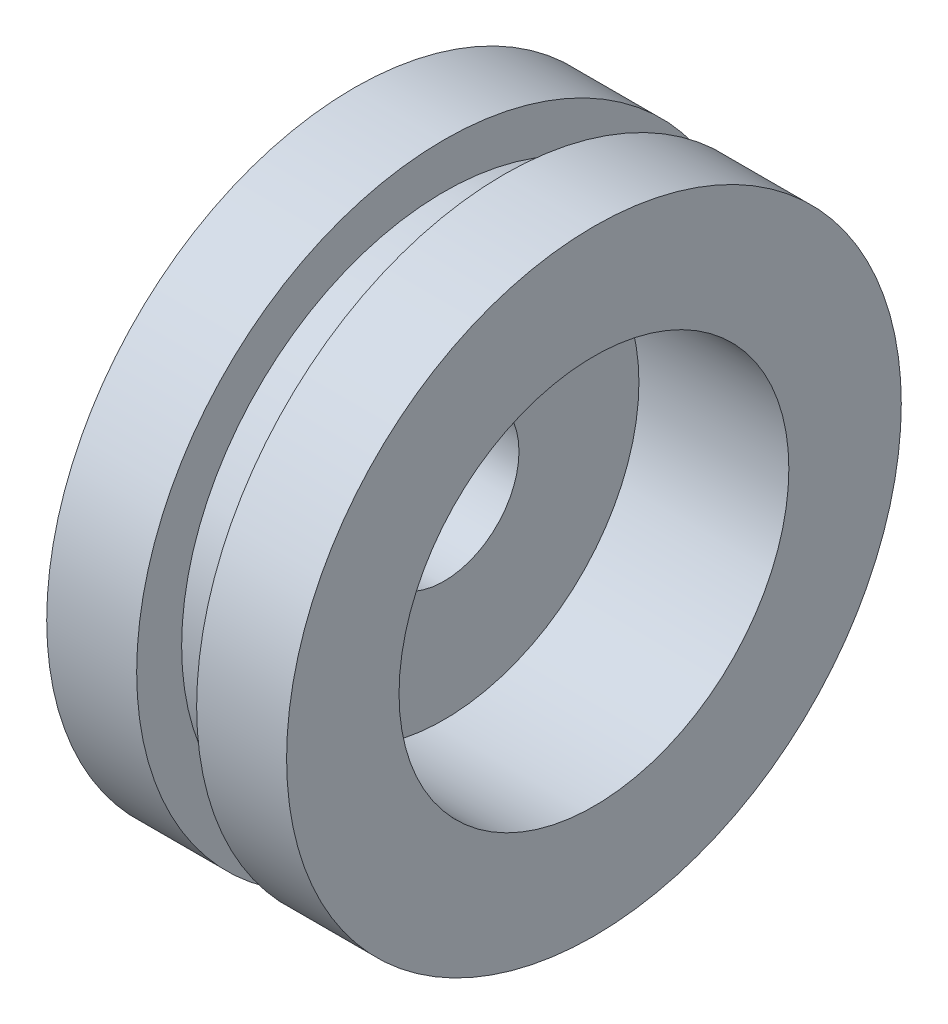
ISO-10303-21;
HEADER;
FILE_DESCRIPTION(('STEP AP214'),'2;1');
FILE_NAME('part.step','',(''),(''),'','','');
FILE_SCHEMA(('AUTOMOTIVE_DESIGN { 1 0 10303 214 1 1 1 1 }'));
ENDSEC;
DATA;
#1=APPLICATION_CONTEXT('core data for automotive mechanical design processes');
#2=APPLICATION_PROTOCOL_DEFINITION('international standard','automotive_design',2000,#1);
#3=PRODUCT_CONTEXT('',#1,'mechanical');
#4=PRODUCT('Part','Part','',(#3));
#5=PRODUCT_RELATED_PRODUCT_CATEGORY('part','',(#4));
#6=PRODUCT_DEFINITION_FORMATION('','',#4);
#7=PRODUCT_DEFINITION_CONTEXT('part definition',#1,'design');
#8=PRODUCT_DEFINITION('design','',#6,#7);
#9=PRODUCT_DEFINITION_SHAPE('','',#8);
#10=(LENGTH_UNIT() NAMED_UNIT(*) SI_UNIT(.MILLI.,.METRE.));
#11=(NAMED_UNIT(*) PLANE_ANGLE_UNIT() SI_UNIT($,.RADIAN.));
#12=(NAMED_UNIT(*) SI_UNIT($,.STERADIAN.) SOLID_ANGLE_UNIT());
#13=UNCERTAINTY_MEASURE_WITH_UNIT(LENGTH_MEASURE(1.E-05),#10,'distance_accuracy_value','');
#14=(GEOMETRIC_REPRESENTATION_CONTEXT(3) GLOBAL_UNCERTAINTY_ASSIGNED_CONTEXT((#13)) GLOBAL_UNIT_ASSIGNED_CONTEXT((#10,
#11,#12)) REPRESENTATION_CONTEXT('',''));
#15=CARTESIAN_POINT('',(0.,0.,0.));
#16=DIRECTION('',(0.,0.,1.));
#17=DIRECTION('',(1.,0.,0.));
#18=AXIS2_PLACEMENT_3D('',#15,#16,#17);
#19=CARTESIAN_POINT('',(16.,0.,0.));
#20=DIRECTION('',(-1.,0.,0.));
#21=DIRECTION('',(0.,0.,1.));
#22=AXIS2_PLACEMENT_3D('',#19,#20,#21);
#23=CYLINDRICAL_SURFACE('',#22,20.5);
#24=CARTESIAN_POINT('',(6.,0.,0.));
#25=DIRECTION('',(-1.,0.,0.));
#26=DIRECTION('',(0.,0.,1.));
#27=AXIS2_PLACEMENT_3D('',#24,#25,#26);
#28=CIRCLE('',#27,20.5);
#29=CARTESIAN_POINT('',(6.,0.,20.5));
#30=VERTEX_POINT('',#29);
#31=EDGE_CURVE('E29',#30,#30,#28,.T.);
#32=ORIENTED_EDGE('',*,*,#31,.T.);
#33=EDGE_LOOP('',(#32));
#34=FACE_BOUND('',#33,.T.);
#35=CARTESIAN_POINT('',(0.,0.,0.));
#36=DIRECTION('',(1.,0.,0.));
#37=DIRECTION('',(0.,0.,-1.));
#38=AXIS2_PLACEMENT_3D('',#35,#36,#37);
#39=CIRCLE('',#38,20.5);
#40=CARTESIAN_POINT('',(0.,0.,-20.5));
#41=VERTEX_POINT('',#40);
#42=EDGE_CURVE('E33',#41,#41,#39,.T.);
#43=ORIENTED_EDGE('',*,*,#42,.T.);
#44=EDGE_LOOP('',(#43));
#45=FACE_BOUND('',#44,.T.);
#46=ADVANCED_FACE('F25',(#34,#45),#23,.T.);
#47=CARTESIAN_POINT('',(10.,0.,0.));
#48=DIRECTION('',(1.,0.,0.));
#49=DIRECTION('',(0.,0.,-1.));
#50=AXIS2_PLACEMENT_3D('',#47,#48,#49);
#51=CIRCLE('',#50,20.5);
#52=CARTESIAN_POINT('',(10.,0.,-20.5));
#53=VERTEX_POINT('',#52);
#54=EDGE_CURVE('E41',#53,#53,#51,.T.);
#55=ORIENTED_EDGE('',*,*,#54,.T.);
#56=EDGE_LOOP('',(#55));
#57=FACE_BOUND('',#56,.T.);
#58=CARTESIAN_POINT('',(16.,0.,0.));
#59=DIRECTION('',(1.,0.,0.));
#60=DIRECTION('',(0.,0.,-1.));
#61=AXIS2_PLACEMENT_3D('',#58,#59,#60);
#62=CIRCLE('',#61,20.5);
#63=CARTESIAN_POINT('',(16.,0.,-20.5));
#64=VERTEX_POINT('',#63);
#65=EDGE_CURVE('E10',#64,#64,#62,.T.);
#66=ORIENTED_EDGE('',*,*,#65,.F.);
#67=EDGE_LOOP('',(#66));
#68=FACE_BOUND('',#67,.T.);
#69=ADVANCED_FACE('F27',(#57,#68),#23,.T.);
#70=CARTESIAN_POINT('',(16.,0.,0.));
#71=DIRECTION('',(1.,0.,0.));
#72=DIRECTION('',(0.,0.,-1.));
#73=AXIS2_PLACEMENT_3D('',#70,#71,#72);
#74=PLANE('',#73);
#75=CARTESIAN_POINT('',(16.,0.,0.));
#76=DIRECTION('',(1.,0.,0.));
#77=DIRECTION('',(0.,0.,-1.));
#78=AXIS2_PLACEMENT_3D('',#75,#76,#77);
#79=CIRCLE('',#78,13.);
#80=CARTESIAN_POINT('',(16.,0.,-13.));
#81=VERTEX_POINT('',#80);
#82=EDGE_CURVE('E61',#81,#81,#79,.T.);
#83=ORIENTED_EDGE('',*,*,#82,.F.);
#84=EDGE_LOOP('',(#83));
#85=FACE_BOUND('',#84,.T.);
#86=ORIENTED_EDGE('',*,*,#65,.T.);
#87=EDGE_LOOP('',(#86));
#88=FACE_BOUND('',#87,.T.);
#89=ADVANCED_FACE('F76',(#85,#88),#74,.T.);
#90=CARTESIAN_POINT('',(0.,0.,0.));
#91=DIRECTION('',(1.,0.,0.));
#92=DIRECTION('',(0.,0.,-1.));
#93=AXIS2_PLACEMENT_3D('',#90,#91,#92);
#94=PLANE('',#93);
#95=CARTESIAN_POINT('',(0.,0.,0.));
#96=DIRECTION('',(1.,0.,0.));
#97=DIRECTION('',(0.,0.,-1.));
#98=AXIS2_PLACEMENT_3D('',#95,#96,#97);
#99=CIRCLE('',#98,5.);
#100=CARTESIAN_POINT('',(0.,0.,-5.));
#101=VERTEX_POINT('',#100);
#102=EDGE_CURVE('E58',#101,#101,#99,.T.);
#103=ORIENTED_EDGE('',*,*,#102,.T.);
#104=EDGE_LOOP('',(#103));
#105=FACE_BOUND('',#104,.T.);
#106=ORIENTED_EDGE('',*,*,#42,.F.);
#107=EDGE_LOOP('',(#106));
#108=FACE_BOUND('',#107,.T.);
#109=ADVANCED_FACE('F71',(#105,#108),#94,.F.);
#110=CARTESIAN_POINT('',(6.,0.,0.));
#111=DIRECTION('',(1.,0.,0.));
#112=DIRECTION('',(0.,0.,-1.));
#113=AXIS2_PLACEMENT_3D('',#110,#111,#112);
#114=CYLINDRICAL_SURFACE('',#113,13.);
#115=CARTESIAN_POINT('',(6.,0.,0.));
#116=DIRECTION('',(1.,0.,0.));
#117=DIRECTION('',(0.,0.,-1.));
#118=AXIS2_PLACEMENT_3D('',#115,#116,#117);
#119=CIRCLE('',#118,13.);
#120=CARTESIAN_POINT('',(6.,0.,-13.));
#121=VERTEX_POINT('',#120);
#122=EDGE_CURVE('E38',#121,#121,#119,.T.);
#123=ORIENTED_EDGE('',*,*,#122,.F.);
#124=EDGE_LOOP('',(#123));
#125=FACE_BOUND('',#124,.T.);
#126=ORIENTED_EDGE('',*,*,#82,.T.);
#127=EDGE_LOOP('',(#126));
#128=FACE_BOUND('',#127,.T.);
#129=ADVANCED_FACE('F68',(#125,#128),#114,.F.);
#130=CARTESIAN_POINT('',(6.,0.,0.));
#131=DIRECTION('',(1.,0.,0.));
#132=DIRECTION('',(0.,0.,-1.));
#133=AXIS2_PLACEMENT_3D('',#130,#131,#132);
#134=PLANE('',#133);
#135=CARTESIAN_POINT('',(6.,0.,0.));
#136=DIRECTION('',(1.,0.,0.));
#137=DIRECTION('',(0.,0.,-1.));
#138=AXIS2_PLACEMENT_3D('',#135,#136,#137);
#139=CIRCLE('',#138,5.);
#140=CARTESIAN_POINT('',(6.,0.,-5.));
#141=VERTEX_POINT('',#140);
#142=EDGE_CURVE('E47',#141,#141,#139,.T.);
#143=ORIENTED_EDGE('',*,*,#142,.F.);
#144=EDGE_LOOP('',(#143));
#145=FACE_BOUND('',#144,.T.);
#146=ORIENTED_EDGE('',*,*,#122,.T.);
#147=EDGE_LOOP('',(#146));
#148=FACE_BOUND('',#147,.T.);
#149=ADVANCED_FACE('F66',(#145,#148),#134,.T.);
#150=CARTESIAN_POINT('',(0.,0.,0.));
#151=DIRECTION('',(1.,0.,0.));
#152=DIRECTION('',(0.,0.,-1.));
#153=AXIS2_PLACEMENT_3D('',#150,#151,#152);
#154=CYLINDRICAL_SURFACE('',#153,5.);
#155=ORIENTED_EDGE('',*,*,#102,.F.);
#156=EDGE_LOOP('',(#155));
#157=FACE_BOUND('',#156,.T.);
#158=ORIENTED_EDGE('',*,*,#142,.T.);
#159=EDGE_LOOP('',(#158));
#160=FACE_BOUND('',#159,.T.);
#161=ADVANCED_FACE('F73',(#157,#160),#154,.F.);
#162=CARTESIAN_POINT('',(6.,17.5,0.));
#163=DIRECTION('',(-1.,0.,0.));
#164=DIRECTION('',(0.,0.,1.));
#165=AXIS2_PLACEMENT_3D('',#162,#163,#164);
#166=PLANE('',#165);
#167=CARTESIAN_POINT('',(6.,0.,0.));
#168=DIRECTION('',(-1.,0.,0.));
#169=DIRECTION('',(0.,0.,1.));
#170=AXIS2_PLACEMENT_3D('',#167,#168,#169);
#171=CIRCLE('',#170,17.5);
#172=CARTESIAN_POINT('',(6.,0.,17.5));
#173=VERTEX_POINT('',#172);
#174=EDGE_CURVE('E43',#173,#173,#171,.T.);
#175=ORIENTED_EDGE('',*,*,#174,.T.);
#176=EDGE_LOOP('',(#175));
#177=FACE_BOUND('',#176,.T.);
#178=ORIENTED_EDGE('',*,*,#31,.F.);
#179=EDGE_LOOP('',(#178));
#180=FACE_BOUND('',#179,.T.);
#181=ADVANCED_FACE('F93',(#177,#180),#166,.F.);
#182=CARTESIAN_POINT('',(10.,30.,0.));
#183=DIRECTION('',(1.,0.,0.));
#184=DIRECTION('',(0.,0.,-1.));
#185=AXIS2_PLACEMENT_3D('',#182,#183,#184);
#186=PLANE('',#185);
#187=CARTESIAN_POINT('',(10.,0.,0.));
#188=DIRECTION('',(-1.,0.,0.));
#189=DIRECTION('',(0.,0.,1.));
#190=AXIS2_PLACEMENT_3D('',#187,#188,#189);
#191=CIRCLE('',#190,17.5);
#192=CARTESIAN_POINT('',(10.,0.,17.5));
#193=VERTEX_POINT('',#192);
#194=EDGE_CURVE('E49',#193,#193,#191,.T.);
#195=ORIENTED_EDGE('',*,*,#194,.F.);
#196=EDGE_LOOP('',(#195));
#197=FACE_BOUND('',#196,.T.);
#198=ORIENTED_EDGE('',*,*,#54,.F.);
#199=EDGE_LOOP('',(#198));
#200=FACE_BOUND('',#199,.T.);
#201=ADVANCED_FACE('F95',(#197,#200),#186,.F.);
#202=CARTESIAN_POINT('',(-8.24237864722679,0.,0.));
#203=DIRECTION('',(-1.,0.,0.));
#204=DIRECTION('',(0.,0.,1.));
#205=AXIS2_PLACEMENT_3D('',#202,#203,#204);
#206=CYLINDRICAL_SURFACE('',#205,17.5);
#207=ORIENTED_EDGE('',*,*,#174,.F.);
#208=EDGE_LOOP('',(#207));
#209=FACE_BOUND('',#208,.T.);
#210=ORIENTED_EDGE('',*,*,#194,.T.);
#211=EDGE_LOOP('',(#210));
#212=FACE_BOUND('',#211,.T.);
#213=ADVANCED_FACE('F101',(#209,#212),#206,.T.);
#214=CLOSED_SHELL('',(#46,#69,#89,#109,#129,#149,#161,#181,#201,#213));
#215=MANIFOLD_SOLID_BREP('B2',#214);
#216=ADVANCED_BREP_SHAPE_REPRESENTATION('',(#18,#215),#14);
#217=SHAPE_DEFINITION_REPRESENTATION(#9,#216);
ENDSEC;
END-ISO-10303-21;
